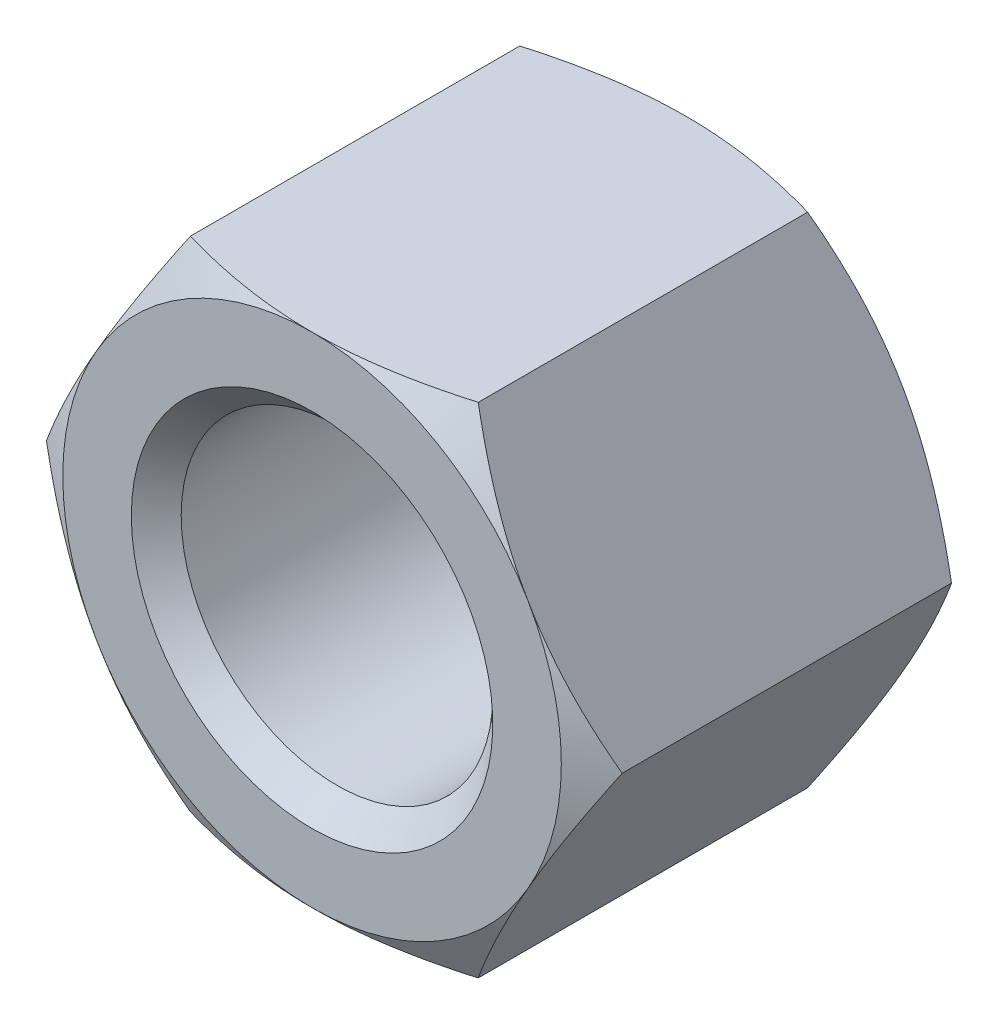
ISO-10303-21;
HEADER;
FILE_DESCRIPTION(('STEP AP214'),'2;1');
FILE_NAME('part.step','',(''),(''),'','','');
FILE_SCHEMA(('AUTOMOTIVE_DESIGN { 1 0 10303 214 1 1 1 1 }'));
ENDSEC;
DATA;
#1=APPLICATION_CONTEXT('core data for automotive mechanical design processes');
#2=APPLICATION_PROTOCOL_DEFINITION('international standard','automotive_design',2000,#1);
#3=PRODUCT_CONTEXT('',#1,'mechanical');
#4=PRODUCT('Part','Part','',(#3));
#5=PRODUCT_RELATED_PRODUCT_CATEGORY('part','',(#4));
#6=PRODUCT_DEFINITION_FORMATION('','',#4);
#7=PRODUCT_DEFINITION_CONTEXT('part definition',#1,'design');
#8=PRODUCT_DEFINITION('design','',#6,#7);
#9=PRODUCT_DEFINITION_SHAPE('','',#8);
#10=(LENGTH_UNIT() NAMED_UNIT(*) SI_UNIT(.MILLI.,.METRE.));
#11=(NAMED_UNIT(*) PLANE_ANGLE_UNIT() SI_UNIT($,.RADIAN.));
#12=(NAMED_UNIT(*) SI_UNIT($,.STERADIAN.) SOLID_ANGLE_UNIT());
#13=UNCERTAINTY_MEASURE_WITH_UNIT(LENGTH_MEASURE(1.E-05),#10,'distance_accuracy_value','');
#14=(GEOMETRIC_REPRESENTATION_CONTEXT(3) GLOBAL_UNCERTAINTY_ASSIGNED_CONTEXT((#13)) GLOBAL_UNIT_ASSIGNED_CONTEXT((#10,
#11,#12)) REPRESENTATION_CONTEXT('',''));
#15=CARTESIAN_POINT('',(0.,0.,0.));
#16=DIRECTION('',(0.,0.,1.));
#17=DIRECTION('',(1.,0.,0.));
#18=AXIS2_PLACEMENT_3D('',#15,#16,#17);
#19=CARTESIAN_POINT('',(4.61880215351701,0.,-3.));
#20=DIRECTION('',(0.866025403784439,0.5,0.));
#21=DIRECTION('',(-0.5,0.866025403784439,0.));
#22=AXIS2_PLACEMENT_3D('',#19,#20,#21);
#23=PLANE('',#22);
#24=CARTESIAN_POINT('',(4.61891762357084,-0.000199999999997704,2.64266774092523));
#25=CARTESIAN_POINT('',(4.51743148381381,0.17557915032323,2.70128212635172));
#26=CARTESIAN_POINT('',(4.41506932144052,0.352875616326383,2.75458967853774));
#27=CARTESIAN_POINT('',(4.20857250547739,0.710538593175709,2.8476383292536));
#28=CARTESIAN_POINT('',(4.10443418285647,0.890911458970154,2.8873465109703));
#29=CARTESIAN_POINT('',(3.89744813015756,1.24942181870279,2.94915778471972));
#30=CARTESIAN_POINT('',(3.79463224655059,1.42750415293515,2.97167226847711));
#31=CARTESIAN_POINT('',(3.58851671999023,1.78450671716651,2.99854937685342));
#32=CARTESIAN_POINT('',(3.48521782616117,1.9634256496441,3.00293425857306));
#33=CARTESIAN_POINT('',(3.29219970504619,2.29774284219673,2.99380992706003));
#34=CARTESIAN_POINT('',(3.20245157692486,2.45319115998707,2.98254104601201));
#35=CARTESIAN_POINT('',(3.02354002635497,2.76307505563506,2.94682600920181));
#36=CARTESIAN_POINT('',(2.93437722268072,2.91750956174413,2.92236765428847));
#37=CARTESIAN_POINT('',(2.75509682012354,3.22803232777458,2.86122393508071));
#38=CARTESIAN_POINT('',(2.6650019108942,3.3840812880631,2.82427939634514));
#39=CARTESIAN_POINT('',(2.48615580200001,3.69385183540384,2.74042992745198));
#40=CARTESIAN_POINT('',(2.39740231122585,3.84757739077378,2.69354469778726));
#41=CARTESIAN_POINT('',(2.30928560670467,4.0002,2.64266774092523));
#42=B_SPLINE_CURVE_WITH_KNOTS('',3,(#24,#25,#26,#27,#28,#29,#30,#31,#32,#33,#34,#35,#36,#37,#38,
#39,#40,#41),.UNSPECIFIED.,.F.,.F.,(4,2,2,2,2,2,2,2,4),(0.,0.634047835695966,1.26961969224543,
1.88946157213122,2.50854226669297,3.04757825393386,3.58711366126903,4.13861653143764,
4.68903648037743),.UNSPECIFIED.);
#43=CARTESIAN_POINT('',(4.61880215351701,0.,2.64273441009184));
#44=VERTEX_POINT('',#43);
#45=CARTESIAN_POINT('',(3.46410161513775,2.,3.));
#46=VERTEX_POINT('',#45);
#47=EDGE_CURVE('E127',#44,#46,#42,.T.);
#48=ORIENTED_EDGE('',*,*,#47,.F.);
#49=DIRECTION('',(0.,0.,1.));
#50=VECTOR('',#49,1.);
#51=CARTESIAN_POINT('',(4.61880215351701,0.,-3.));
#52=LINE('',#51,#50);
#53=CARTESIAN_POINT('',(4.61880215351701,0.,-2.64273441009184));
#54=VERTEX_POINT('',#53);
#55=EDGE_CURVE('E558',#54,#44,#52,.T.);
#56=ORIENTED_EDGE('',*,*,#55,.F.);
#57=CARTESIAN_POINT('',(4.61891762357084,-0.000199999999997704,-2.64266774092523));
#58=CARTESIAN_POINT('',(4.51743148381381,0.17557915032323,-2.70128212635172));
#59=CARTESIAN_POINT('',(4.41506932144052,0.352875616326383,-2.75458967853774));
#60=CARTESIAN_POINT('',(4.20857250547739,0.710538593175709,-2.8476383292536));
#61=CARTESIAN_POINT('',(4.10443418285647,0.890911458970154,-2.8873465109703));
#62=CARTESIAN_POINT('',(3.89744813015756,1.24942181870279,-2.94915778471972));
#63=CARTESIAN_POINT('',(3.79463224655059,1.42750415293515,-2.97167226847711));
#64=CARTESIAN_POINT('',(3.58851671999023,1.78450671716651,-2.99854937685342));
#65=CARTESIAN_POINT('',(3.48521782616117,1.9634256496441,-3.00293425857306));
#66=CARTESIAN_POINT('',(3.29219970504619,2.29774284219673,-2.99380992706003));
#67=CARTESIAN_POINT('',(3.20245157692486,2.45319115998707,-2.98254104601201));
#68=CARTESIAN_POINT('',(3.02354002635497,2.76307505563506,-2.94682600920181));
#69=CARTESIAN_POINT('',(2.93437722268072,2.91750956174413,-2.92236765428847));
#70=CARTESIAN_POINT('',(2.75509682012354,3.22803232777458,-2.86122393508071));
#71=CARTESIAN_POINT('',(2.6650019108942,3.3840812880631,-2.82427939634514));
#72=CARTESIAN_POINT('',(2.48615580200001,3.69385183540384,-2.74042992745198));
#73=CARTESIAN_POINT('',(2.39740231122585,3.84757739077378,-2.69354469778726));
#74=CARTESIAN_POINT('',(2.30928560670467,4.0002,-2.64266774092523));
#75=B_SPLINE_CURVE_WITH_KNOTS('',3,(#57,#58,#59,#60,#61,#62,#63,#64,#65,#66,#67,#68,#69,#70,#71,
#72,#73,#74),.UNSPECIFIED.,.F.,.F.,(4,2,2,2,2,2,2,2,4),(0.,0.634047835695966,1.26961969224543,
1.88946157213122,2.50854226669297,3.04757825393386,3.58711366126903,4.13861653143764,
4.68903648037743),.UNSPECIFIED.);
#76=CARTESIAN_POINT('',(3.46410161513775,2.,-3.));
#77=VERTEX_POINT('',#76);
#78=EDGE_CURVE('E540',#54,#77,#75,.T.);
#79=ORIENTED_EDGE('',*,*,#78,.T.);
#80=CARTESIAN_POINT('',(2.3094010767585,4.,-2.64273441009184));
#81=VERTEX_POINT('',#80);
#82=EDGE_CURVE('E269',#77,#81,#75,.T.);
#83=ORIENTED_EDGE('',*,*,#82,.T.);
#84=DIRECTION('',(0.,0.,1.));
#85=VECTOR('',#84,1.);
#86=CARTESIAN_POINT('',(2.3094010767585,4.,-3.));
#87=LINE('',#86,#85);
#88=CARTESIAN_POINT('',(2.3094010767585,4.,2.64273441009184));
#89=VERTEX_POINT('',#88);
#90=EDGE_CURVE('E159',#81,#89,#87,.T.);
#91=ORIENTED_EDGE('',*,*,#90,.T.);
#92=EDGE_CURVE('E140',#46,#89,#42,.T.);
#93=ORIENTED_EDGE('',*,*,#92,.F.);
#94=EDGE_LOOP('',(#48,#56,#79,#83,#91,#93));
#95=FACE_BOUND('',#94,.T.);
#96=ADVANCED_FACE('F41',(#95),#23,.T.);
#97=CARTESIAN_POINT('',(2.3094010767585,-4.,-3.));
#98=DIRECTION('',(0.866025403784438,-0.5,0.));
#99=DIRECTION('',(0.5,0.866025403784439,0.));
#100=AXIS2_PLACEMENT_3D('',#97,#98,#99);
#101=PLANE('',#100);
#102=CARTESIAN_POINT('',(2.30928560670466,-4.0002,2.64266774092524));
#103=CARTESIAN_POINT('',(2.4107717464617,-3.82442084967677,2.70128212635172));
#104=CARTESIAN_POINT('',(2.51313390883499,-3.64712438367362,2.75458967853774));
#105=CARTESIAN_POINT('',(2.71963072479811,-3.28946140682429,2.8476383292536));
#106=CARTESIAN_POINT('',(2.82376904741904,-3.10908854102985,2.8873465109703));
#107=CARTESIAN_POINT('',(3.03075510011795,-2.75057818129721,2.94915778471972));
#108=CARTESIAN_POINT('',(3.13357098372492,-2.57249584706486,2.97167226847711));
#109=CARTESIAN_POINT('',(3.33968651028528,-2.21549328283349,2.99854937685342));
#110=CARTESIAN_POINT('',(3.44298540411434,-2.0365743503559,3.00293425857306));
#111=CARTESIAN_POINT('',(3.63600352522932,-1.70225715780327,2.99380992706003));
#112=CARTESIAN_POINT('',(3.72575165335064,-1.54680884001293,2.98254104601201));
#113=CARTESIAN_POINT('',(3.90466320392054,-1.23692494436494,2.94682600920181));
#114=CARTESIAN_POINT('',(3.99382600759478,-1.08249043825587,2.92236765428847));
#115=CARTESIAN_POINT('',(4.17310641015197,-0.77196767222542,2.86122393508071));
#116=CARTESIAN_POINT('',(4.26320131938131,-0.615918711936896,2.82427939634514));
#117=CARTESIAN_POINT('',(4.4420474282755,-0.306148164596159,2.74042992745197));
#118=CARTESIAN_POINT('',(4.53080091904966,-0.152422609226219,2.69354469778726));
#119=CARTESIAN_POINT('',(4.61891762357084,0.000200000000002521,2.64266774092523));
#120=B_SPLINE_CURVE_WITH_KNOTS('',3,(#102,#103,#104,#105,#106,#107,#108,#109,#110,#111,#112,
#113,#114,#115,#116,#117,#118,#119),.UNSPECIFIED.,.F.,.F.,(4,2,2,2,2,2,2,2,4),(0.,
0.634047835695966,1.26961969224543,1.88946157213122,2.50854226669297,3.04757825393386,
3.58711366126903,4.13861653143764,4.68903648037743),.UNSPECIFIED.);
#121=CARTESIAN_POINT('',(2.3094010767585,-4.,2.64273441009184));
#122=VERTEX_POINT('',#121);
#123=CARTESIAN_POINT('',(3.46410161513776,-2.,3.));
#124=VERTEX_POINT('',#123);
#125=EDGE_CURVE('E533',#122,#124,#120,.T.);
#126=ORIENTED_EDGE('',*,*,#125,.F.);
#127=DIRECTION('',(0.,0.,1.));
#128=VECTOR('',#127,1.);
#129=CARTESIAN_POINT('',(2.3094010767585,-4.,-3.));
#130=LINE('',#129,#128);
#131=CARTESIAN_POINT('',(2.3094010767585,-4.,-2.64273441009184));
#132=VERTEX_POINT('',#131);
#133=EDGE_CURVE('E283',#132,#122,#130,.T.);
#134=ORIENTED_EDGE('',*,*,#133,.F.);
#135=CARTESIAN_POINT('',(2.30928560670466,-4.0002,-2.64266774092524));
#136=CARTESIAN_POINT('',(2.4107717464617,-3.82442084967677,-2.70128212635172));
#137=CARTESIAN_POINT('',(2.51313390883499,-3.64712438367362,-2.75458967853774));
#138=CARTESIAN_POINT('',(2.71963072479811,-3.28946140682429,-2.8476383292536));
#139=CARTESIAN_POINT('',(2.82376904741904,-3.10908854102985,-2.8873465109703));
#140=CARTESIAN_POINT('',(3.03075510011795,-2.75057818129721,-2.94915778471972));
#141=CARTESIAN_POINT('',(3.13357098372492,-2.57249584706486,-2.97167226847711));
#142=CARTESIAN_POINT('',(3.33968651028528,-2.21549328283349,-2.99854937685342));
#143=CARTESIAN_POINT('',(3.44298540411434,-2.0365743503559,-3.00293425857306));
#144=CARTESIAN_POINT('',(3.63600352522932,-1.70225715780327,-2.99380992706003));
#145=CARTESIAN_POINT('',(3.72575165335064,-1.54680884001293,-2.98254104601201));
#146=CARTESIAN_POINT('',(3.90466320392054,-1.23692494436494,-2.94682600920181));
#147=CARTESIAN_POINT('',(3.99382600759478,-1.08249043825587,-2.92236765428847));
#148=CARTESIAN_POINT('',(4.17310641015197,-0.77196767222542,-2.86122393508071));
#149=CARTESIAN_POINT('',(4.26320131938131,-0.615918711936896,-2.82427939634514));
#150=CARTESIAN_POINT('',(4.4420474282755,-0.306148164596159,-2.74042992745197));
#151=CARTESIAN_POINT('',(4.53080091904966,-0.152422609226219,-2.69354469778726));
#152=CARTESIAN_POINT('',(4.61891762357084,0.000200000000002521,-2.64266774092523));
#153=B_SPLINE_CURVE_WITH_KNOTS('',3,(#135,#136,#137,#138,#139,#140,#141,#142,#143,#144,#145,
#146,#147,#148,#149,#150,#151,#152),.UNSPECIFIED.,.F.,.F.,(4,2,2,2,2,2,2,2,4),(0.,
0.634047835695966,1.26961969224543,1.88946157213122,2.50854226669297,3.04757825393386,
3.58711366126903,4.13861653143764,4.68903648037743),.UNSPECIFIED.);
#154=CARTESIAN_POINT('',(3.46410161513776,-2.,-3.));
#155=VERTEX_POINT('',#154);
#156=EDGE_CURVE('E546',#132,#155,#153,.T.);
#157=ORIENTED_EDGE('',*,*,#156,.T.);
#158=EDGE_CURVE('E284',#155,#54,#153,.T.);
#159=ORIENTED_EDGE('',*,*,#158,.T.);
#160=ORIENTED_EDGE('',*,*,#55,.T.);
#161=EDGE_CURVE('E132',#124,#44,#120,.T.);
#162=ORIENTED_EDGE('',*,*,#161,.F.);
#163=EDGE_LOOP('',(#126,#134,#157,#159,#160,#162));
#164=FACE_BOUND('',#163,.T.);
#165=ADVANCED_FACE('F254',(#164),#101,.T.);
#166=CARTESIAN_POINT('',(-2.3094010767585,-4.,-3.));
#167=DIRECTION('',(0.,-1.,0.));
#168=DIRECTION('',(0.,0.,-1.));
#169=AXIS2_PLACEMENT_3D('',#166,#167,#168);
#170=PLANE('',#169);
#171=CARTESIAN_POINT('',(-9.20954650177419,-4.,-0.487602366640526));
#172=CARTESIAN_POINT('',(-8.99996160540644,-4.,-0.376626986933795));
#173=CARTESIAN_POINT('',(-8.79013626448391,-4.,-0.266102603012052));
#174=CARTESIAN_POINT('',(-8.36988903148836,-4.,-0.0461895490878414));
#175=CARTESIAN_POINT('',(-8.15946713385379,-4.,0.0631991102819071));
#176=CARTESIAN_POINT('',(-7.73766371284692,-4.,0.280734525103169));
#177=CARTESIAN_POINT('',(-7.52628134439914,-4.,0.388879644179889));
#178=CARTESIAN_POINT('',(-7.10265211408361,-4.,0.603471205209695));
#179=CARTESIAN_POINT('',(-6.89040524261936,-4.,0.709917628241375));
#180=CARTESIAN_POINT('',(-6.45325708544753,-4.,0.926433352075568));
#181=CARTESIAN_POINT('',(-6.22829678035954,-4.,1.03638375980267));
#182=CARTESIAN_POINT('',(-5.77692279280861,-4.,1.25324682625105));
#183=CARTESIAN_POINT('',(-5.55050916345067,-4.,1.36015959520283));
#184=CARTESIAN_POINT('',(-5.09596404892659,-4.,1.5699627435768));
#185=CARTESIAN_POINT('',(-4.86783354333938,-4.,1.67285523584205));
#186=CARTESIAN_POINT('',(-4.40921468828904,-4.,1.87337963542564));
#187=CARTESIAN_POINT('',(-4.17872594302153,-4.,1.9710106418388));
#188=CARTESIAN_POINT('',(-3.69446468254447,-4.,2.1673874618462));
#189=CARTESIAN_POINT('',(-3.44042380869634,-4.,2.26547932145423));
#190=CARTESIAN_POINT('',(-2.92809810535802,-4.,2.44970610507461));
#191=CARTESIAN_POINT('',(-2.66981494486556,-4.,2.53584561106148));
#192=CARTESIAN_POINT('',(-2.15306355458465,-4.,2.68974681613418));
#193=CARTESIAN_POINT('',(-1.89469451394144,-4.,2.75783024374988));
#194=CARTESIAN_POINT('',(-1.50352927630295,-4.,2.84322641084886));
#195=CARTESIAN_POINT('',(-1.37255212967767,-4.,2.8689019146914));
#196=CARTESIAN_POINT('',(-1.10952089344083,-4.,2.91390029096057));
#197=CARTESIAN_POINT('',(-0.977467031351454,-4.,2.93322447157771));
#198=CARTESIAN_POINT('',(-0.733112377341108,-4.,2.96238395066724));
#199=CARTESIAN_POINT('',(-0.620931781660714,-4.,2.97322729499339));
#200=CARTESIAN_POINT('',(-0.39619387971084,-4.,2.98959144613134));
#201=CARTESIAN_POINT('',(-0.283636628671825,-4.,2.99511300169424));
#202=CARTESIAN_POINT('',(-0.058408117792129,-4.,3.00066724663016));
#203=CARTESIAN_POINT('',(0.0542631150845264,-4.,3.00070102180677));
#204=CARTESIAN_POINT('',(0.27947370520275,-4.,2.9952816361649));
#205=CARTESIAN_POINT('',(0.392013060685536,-4.,2.98982840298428));
#206=CARTESIAN_POINT('',(0.61874511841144,-4.,2.97345272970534));
#207=CARTESIAN_POINT('',(0.732930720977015,-4.,2.96243274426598));
#208=CARTESIAN_POINT('',(0.960682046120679,-4.,2.93519991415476));
#209=CARTESIAN_POINT('',(1.07424773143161,-4.,2.9189867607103));
#210=CARTESIAN_POINT('',(1.30061751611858,-4.,2.88179418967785));
#211=CARTESIAN_POINT('',(1.41342143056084,-4.,2.86081365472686));
#212=CARTESIAN_POINT('',(1.63813713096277,-4.,2.81457504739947));
#213=CARTESIAN_POINT('',(1.75004894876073,-4.,2.78931712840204));
#214=CARTESIAN_POINT('',(2.02981552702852,-4.,2.72116797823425));
#215=CARTESIAN_POINT('',(2.1970807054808,-4.,2.67585504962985));
#216=CARTESIAN_POINT('',(2.52956420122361,-4.,2.57821125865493));
#217=CARTESIAN_POINT('',(2.69478201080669,-4.,2.52587869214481));
#218=CARTESIAN_POINT('',(3.02347594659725,-4.,2.41552751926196));
#219=CARTESIAN_POINT('',(3.18695019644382,-4.,2.35750336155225));
#220=CARTESIAN_POINT('',(3.51220118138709,-4.,2.23694186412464));
#221=CARTESIAN_POINT('',(3.67397804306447,-4.,2.17440486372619));
#222=CARTESIAN_POINT('',(3.99688309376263,-4.,2.04538407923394));
#223=CARTESIAN_POINT('',(4.15800398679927,-4.,1.9788821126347));
#224=CARTESIAN_POINT('',(4.47899441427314,-4.,1.84291723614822));
#225=CARTESIAN_POINT('',(4.63886389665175,-4.,1.77345420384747));
#226=CARTESIAN_POINT('',(5.1167060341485,-4.,1.56156399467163));
#227=CARTESIAN_POINT('',(5.43309229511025,-4.,1.41556228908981));
#228=CARTESIAN_POINT('',(6.04183433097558,-4.,1.1270656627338));
#229=CARTESIAN_POINT('',(6.33438800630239,-4.,0.984984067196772));
#230=CARTESIAN_POINT('',(6.91753132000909,-4.,0.696753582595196));
#231=CARTESIAN_POINT('',(7.20812068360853,-4.,0.550604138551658));
#232=CARTESIAN_POINT('',(7.78452192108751,-4.,0.256991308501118));
#233=CARTESIAN_POINT('',(8.07035078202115,-4.,0.109561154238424));
#234=CARTESIAN_POINT('',(8.64077734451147,-4.,-0.187515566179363));
#235=CARTESIAN_POINT('',(8.92537529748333,-4.,-0.337161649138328));
#236=CARTESIAN_POINT('',(9.20954650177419,-4.,-0.487602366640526));
#237=B_SPLINE_CURVE_WITH_KNOTS('',3,(#171,#172,#173,#174,#175,#176,#177,#178,#179,#180,#181,
#182,#183,#184,#185,#186,#187,#188,#189,#190,#191,#192,#193,#194,#195,#196,#197,#198,#199,#200,
#201,#202,#203,#204,#205,#206,#207,#208,#209,#210,#211,#212,#213,#214,#215,#216,#217,#218,#219,
#220,#221,#222,#223,#224,#225,#226,#227,#228,#229,#230,#231,#232,#233,#234,#235,#236),
.UNSPECIFIED.,.F.,.F.,(4,2,2,2,2,2,2,2,2,2,2,2,2,2,2,2,2,2,2,2,2,2,2,2,2,2,2,2,2,2,2,2,4),(0.,
0.711459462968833,1.42292558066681,2.13524004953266,2.84756244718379,3.5987213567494,
4.34985297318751,5.1005843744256,5.85144391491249,6.66819201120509,7.48462613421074,
8.28535063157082,8.68563323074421,9.08583333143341,9.42382667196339,9.76177245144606,
10.0996513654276,10.437534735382,10.7815555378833,11.1255967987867,11.4697187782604,
11.8138284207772,12.3335061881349,12.8533103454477,13.3736266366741,13.8939038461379,
14.4167843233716,14.9396864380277,15.9849079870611,16.9605651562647,17.9363560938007,
18.9011793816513,19.8657952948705),.UNSPECIFIED.);
#238=CARTESIAN_POINT('',(-2.3094010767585,-4.,2.64273441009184));
#239=VERTEX_POINT('',#238);
#240=CARTESIAN_POINT('',(0.,-4.,3.));
#241=VERTEX_POINT('',#240);
#242=EDGE_CURVE('E534',#239,#241,#237,.T.);
#243=ORIENTED_EDGE('',*,*,#242,.F.);
#244=DIRECTION('',(0.,0.,1.));
#245=VECTOR('',#244,1.);
#246=CARTESIAN_POINT('',(-2.3094010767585,-4.,-3.));
#247=LINE('',#246,#245);
#248=CARTESIAN_POINT('',(-2.3094010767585,-4.,-2.64273441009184));
#249=VERTEX_POINT('',#248);
#250=EDGE_CURVE('E565',#249,#239,#247,.T.);
#251=ORIENTED_EDGE('',*,*,#250,.F.);
#252=CARTESIAN_POINT('',(-7.8171716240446,-4.,-0.23961567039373));
#253=CARTESIAN_POINT('',(-7.63482522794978,-4.,-0.333323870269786));
#254=CARTESIAN_POINT('',(-7.45221019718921,-4.,-0.426513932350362));
#255=CARTESIAN_POINT('',(-7.08632048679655,-4.,-0.611598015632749));
#256=CARTESIAN_POINT('',(-6.90304579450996,-4.,-0.703492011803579));
#257=CARTESIAN_POINT('',(-6.53541813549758,-4.,-0.885871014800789));
#258=CARTESIAN_POINT('',(-6.35106388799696,-4.,-0.976353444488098));
#259=CARTESIAN_POINT('',(-5.98141987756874,-4.,-1.15539669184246));
#260=CARTESIAN_POINT('',(-5.7961301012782,-4.,-1.24395748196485));
#261=CARTESIAN_POINT('',(-5.41472519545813,-4.,-1.42325691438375));
#262=CARTESIAN_POINT('',(-5.21854988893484,-4.,-1.51386790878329));
#263=CARTESIAN_POINT('',(-4.82469000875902,-4.,-1.69173278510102));
#264=CARTESIAN_POINT('',(-4.62700551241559,-4.,-1.7789868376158));
#265=CARTESIAN_POINT('',(-4.22991127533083,-4.,-1.94912171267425));
#266=CARTESIAN_POINT('',(-4.03050278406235,-4.,-2.03200543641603));
#267=CARTESIAN_POINT('',(-3.62937916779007,-4.,-2.19216898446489));
#268=CARTESIAN_POINT('',(-3.42766351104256,-4.,-2.26944748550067));
#269=CARTESIAN_POINT('',(-2.98791439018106,-4.,-2.42879916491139));
#270=CARTESIAN_POINT('',(-2.74939574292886,-4.,-2.50954893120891));
#271=CARTESIAN_POINT('',(-2.26811225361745,-4.,-2.65717758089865));
#272=CARTESIAN_POINT('',(-2.02534965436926,-4.,-2.72406356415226));
#273=CARTESIAN_POINT('',(-1.66021619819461,-4.,-2.80978198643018));
#274=CARTESIAN_POINT('',(-1.53951118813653,-4.,-2.8357368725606));
#275=CARTESIAN_POINT('',(-1.29710140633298,-4.,-2.88250847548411));
#276=CARTESIAN_POINT('',(-1.1753966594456,-4.,-2.90332531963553));
#277=CARTESIAN_POINT('',(-0.931192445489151,-4.,-2.93922594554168));
#278=CARTESIAN_POINT('',(-0.808693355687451,-4.,-2.95431227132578));
#279=CARTESIAN_POINT('',(-0.563090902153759,-4.,-2.97827634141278));
#280=CARTESIAN_POINT('',(-0.439987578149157,-4.,-2.98715448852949));
#281=CARTESIAN_POINT('',(-0.191866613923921,-4.,-2.99846167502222));
#282=CARTESIAN_POINT('',(-0.0668450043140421,-4.,-3.00080479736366));
#283=CARTESIAN_POINT('',(0.18314024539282,-4.,-2.99870720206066));
#284=CARTESIAN_POINT('',(0.30810388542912,-4.,-2.99426647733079));
#285=CARTESIAN_POINT('',(0.557653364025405,-4.,-2.97876571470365));
#286=CARTESIAN_POINT('',(0.682239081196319,-4.,-2.96770373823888));
#287=CARTESIAN_POINT('',(0.930690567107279,-4.,-2.93935627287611));
#288=CARTESIAN_POINT('',(1.05455631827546,-4.,-2.92207063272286));
#289=CARTESIAN_POINT('',(1.42966198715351,-4.,-2.86088380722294));
#290=CARTESIAN_POINT('',(1.67945407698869,-4.,-2.80799457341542));
#291=CARTESIAN_POINT('',(2.17436827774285,-4.,-2.68401694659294));
#292=CARTESIAN_POINT('',(2.41948902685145,-4.,-2.61292333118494));
#293=CARTESIAN_POINT('',(2.89303108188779,-4.,-2.46142937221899));
#294=CARTESIAN_POINT('',(3.12166672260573,-4.,-2.38168814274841));
#295=CARTESIAN_POINT('',(3.57570202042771,-4.,-2.21341780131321));
#296=CARTESIAN_POINT('',(3.80110092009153,-4.,-2.1248866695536));
#297=CARTESIAN_POINT('',(4.249469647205,-4.,-1.9412649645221));
#298=CARTESIAN_POINT('',(4.47243664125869,-4.,-1.84616752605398));
#299=CARTESIAN_POINT('',(4.91621359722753,-4.,-1.6511471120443));
#300=CARTESIAN_POINT('',(5.13702376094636,-4.,-1.55122459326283));
#301=CARTESIAN_POINT('',(5.56467834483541,-4.,-1.35338346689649));
#302=CARTESIAN_POINT('',(5.77161510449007,-4.,-1.25566367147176));
#303=CARTESIAN_POINT('',(6.18426265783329,-4.,-1.05765810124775));
#304=CARTESIAN_POINT('',(6.38997341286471,-4.,-0.9573722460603));
#305=CARTESIAN_POINT('',(6.79974068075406,-4.,-0.755092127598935));
#306=CARTESIAN_POINT('',(7.003800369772,-4.,-0.653104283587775));
#307=CARTESIAN_POINT('',(7.41107383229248,-4.,-0.447494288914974));
#308=CARTESIAN_POINT('',(7.61428767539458,-4.,-0.343872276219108));
#309=CARTESIAN_POINT('',(7.8171716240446,-4.,-0.239615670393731));
#310=B_SPLINE_CURVE_WITH_KNOTS('',3,(#252,#253,#254,#255,#256,#257,#258,#259,#260,#261,#262,
#263,#264,#265,#266,#267,#268,#269,#270,#271,#272,#273,#274,#275,#276,#277,#278,#279,#280,#281,
#282,#283,#284,#285,#286,#287,#288,#289,#290,#291,#292,#293,#294,#295,#296,#297,#298,#299,#300,
#301,#302,#303,#304,#305,#306,#307,#308,#309),.UNSPECIFIED.,.F.,.F.,(4,2,2,2,2,2,2,2,2,2,2,2,2,
2,2,2,2,2,2,2,2,2,2,2,2,2,2,2,4),(0.,0.615049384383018,1.23011063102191,1.84618749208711,
2.46227317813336,3.11052008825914,3.75873401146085,4.40651206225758,5.05444254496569,
5.80961343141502,6.56439662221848,6.9346972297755,7.30498865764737,7.67511550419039,
8.04521833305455,8.4201645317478,8.79511112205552,9.17016754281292,9.54523307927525,
10.3102047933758,11.075396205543,11.8015833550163,12.5279377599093,13.2550634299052,
13.9821204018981,14.6686467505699,15.3551946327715,16.0395673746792,16.7238826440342),.UNSPECIFIED.);
#311=CARTESIAN_POINT('',(0.,-4.,-3.));
#312=VERTEX_POINT('',#311);
#313=EDGE_CURVE('E538',#249,#312,#310,.T.);
#314=ORIENTED_EDGE('',*,*,#313,.T.);
#315=EDGE_CURVE('E259',#312,#132,#310,.T.);
#316=ORIENTED_EDGE('',*,*,#315,.T.);
#317=ORIENTED_EDGE('',*,*,#133,.T.);
#318=EDGE_CURVE('E138',#241,#122,#237,.T.);
#319=ORIENTED_EDGE('',*,*,#318,.F.);
#320=EDGE_LOOP('',(#243,#251,#314,#316,#317,#319));
#321=FACE_BOUND('',#320,.T.);
#322=ADVANCED_FACE('F292',(#321),#170,.T.);
#323=CARTESIAN_POINT('',(-4.61880215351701,0.,-3.));
#324=DIRECTION('',(-0.866025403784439,-0.5,0.));
#325=DIRECTION('',(0.5,-0.866025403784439,0.));
#326=AXIS2_PLACEMENT_3D('',#323,#324,#325);
#327=PLANE('',#326);
#328=CARTESIAN_POINT('',(-4.61891762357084,0.000200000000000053,2.64266774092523));
#329=CARTESIAN_POINT('',(-4.5174314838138,-0.175579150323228,2.70128212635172));
#330=CARTESIAN_POINT('',(-4.41506932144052,-0.352875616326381,2.75458967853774));
#331=CARTESIAN_POINT('',(-4.20857250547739,-0.710538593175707,2.8476383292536));
#332=CARTESIAN_POINT('',(-4.10443418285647,-0.890911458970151,2.8873465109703));
#333=CARTESIAN_POINT('',(-3.89744813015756,-1.24942181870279,2.94915778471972));
#334=CARTESIAN_POINT('',(-3.79463224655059,-1.42750415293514,2.97167226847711));
#335=CARTESIAN_POINT('',(-3.58851671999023,-1.78450671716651,2.99854937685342));
#336=CARTESIAN_POINT('',(-3.48521782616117,-1.9634256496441,3.00293425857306));
#337=CARTESIAN_POINT('',(-3.29219970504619,-2.29774284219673,2.99380992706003));
#338=CARTESIAN_POINT('',(-3.20245157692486,-2.45319115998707,2.98254104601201));
#339=CARTESIAN_POINT('',(-3.02354002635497,-2.76307505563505,2.94682600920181));
#340=CARTESIAN_POINT('',(-2.93437722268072,-2.91750956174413,2.92236765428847));
#341=CARTESIAN_POINT('',(-2.75509682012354,-3.22803232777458,2.86122393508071));
#342=CARTESIAN_POINT('',(-2.6650019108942,-3.3840812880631,2.82427939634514));
#343=CARTESIAN_POINT('',(-2.48615580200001,-3.69385183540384,2.74042992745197));
#344=CARTESIAN_POINT('',(-2.39740231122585,-3.84757739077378,2.69354469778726));
#345=CARTESIAN_POINT('',(-2.30928560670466,-4.0002,2.64266774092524));
#346=B_SPLINE_CURVE_WITH_KNOTS('',3,(#328,#329,#330,#331,#332,#333,#334,#335,#336,#337,#338,
#339,#340,#341,#342,#343,#344,#345),.UNSPECIFIED.,.F.,.F.,(4,2,2,2,2,2,2,2,4),(0.,
0.634047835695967,1.26961969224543,1.88946157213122,2.50854226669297,3.04757825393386,
3.58711366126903,4.13861653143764,4.68903648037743),.UNSPECIFIED.);
#347=CARTESIAN_POINT('',(-4.61880215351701,0.,2.64273441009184));
#348=VERTEX_POINT('',#347);
#349=CARTESIAN_POINT('',(-3.46410161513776,-2.,3.));
#350=VERTEX_POINT('',#349);
#351=EDGE_CURVE('E176',#348,#350,#346,.T.);
#352=ORIENTED_EDGE('',*,*,#351,.F.);
#353=DIRECTION('',(0.,0.,1.));
#354=VECTOR('',#353,1.);
#355=CARTESIAN_POINT('',(-4.61880215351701,0.,-3.));
#356=LINE('',#355,#354);
#357=CARTESIAN_POINT('',(-4.61880215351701,0.,-2.64273441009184));
#358=VERTEX_POINT('',#357);
#359=EDGE_CURVE('E584',#358,#348,#356,.T.);
#360=ORIENTED_EDGE('',*,*,#359,.F.);
#361=CARTESIAN_POINT('',(-4.61891762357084,0.000200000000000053,-2.64266774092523));
#362=CARTESIAN_POINT('',(-4.5174314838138,-0.175579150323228,-2.70128212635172));
#363=CARTESIAN_POINT('',(-4.41506932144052,-0.352875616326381,-2.75458967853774));
#364=CARTESIAN_POINT('',(-4.20857250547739,-0.710538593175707,-2.8476383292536));
#365=CARTESIAN_POINT('',(-4.10443418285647,-0.890911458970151,-2.8873465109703));
#366=CARTESIAN_POINT('',(-3.89744813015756,-1.24942181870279,-2.94915778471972));
#367=CARTESIAN_POINT('',(-3.79463224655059,-1.42750415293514,-2.97167226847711));
#368=CARTESIAN_POINT('',(-3.58851671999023,-1.78450671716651,-2.99854937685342));
#369=CARTESIAN_POINT('',(-3.48521782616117,-1.9634256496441,-3.00293425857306));
#370=CARTESIAN_POINT('',(-3.29219970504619,-2.29774284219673,-2.99380992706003));
#371=CARTESIAN_POINT('',(-3.20245157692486,-2.45319115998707,-2.98254104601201));
#372=CARTESIAN_POINT('',(-3.02354002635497,-2.76307505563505,-2.94682600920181));
#373=CARTESIAN_POINT('',(-2.93437722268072,-2.91750956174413,-2.92236765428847));
#374=CARTESIAN_POINT('',(-2.75509682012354,-3.22803232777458,-2.86122393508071));
#375=CARTESIAN_POINT('',(-2.6650019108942,-3.3840812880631,-2.82427939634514));
#376=CARTESIAN_POINT('',(-2.48615580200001,-3.69385183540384,-2.74042992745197));
#377=CARTESIAN_POINT('',(-2.39740231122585,-3.84757739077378,-2.69354469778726));
#378=CARTESIAN_POINT('',(-2.30928560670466,-4.0002,-2.64266774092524));
#379=B_SPLINE_CURVE_WITH_KNOTS('',3,(#361,#362,#363,#364,#365,#366,#367,#368,#369,#370,#371,
#372,#373,#374,#375,#376,#377,#378),.UNSPECIFIED.,.F.,.F.,(4,2,2,2,2,2,2,2,4),(0.,
0.634047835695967,1.26961969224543,1.88946157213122,2.50854226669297,3.04757825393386,
3.58711366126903,4.13861653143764,4.68903648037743),.UNSPECIFIED.);
#380=CARTESIAN_POINT('',(-3.46410161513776,-2.,-3.));
#381=VERTEX_POINT('',#380);
#382=EDGE_CURVE('E275',#358,#381,#379,.T.);
#383=ORIENTED_EDGE('',*,*,#382,.T.);
#384=EDGE_CURVE('E282',#381,#249,#379,.T.);
#385=ORIENTED_EDGE('',*,*,#384,.T.);
#386=ORIENTED_EDGE('',*,*,#250,.T.);
#387=EDGE_CURVE('E530',#350,#239,#346,.T.);
#388=ORIENTED_EDGE('',*,*,#387,.F.);
#389=EDGE_LOOP('',(#352,#360,#383,#385,#386,#388));
#390=FACE_BOUND('',#389,.T.);
#391=ADVANCED_FACE('F289',(#390),#327,.T.);
#392=CARTESIAN_POINT('',(-2.3094010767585,4.,-3.));
#393=DIRECTION('',(-0.866025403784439,0.5,0.));
#394=DIRECTION('',(-0.5,-0.866025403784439,0.));
#395=AXIS2_PLACEMENT_3D('',#392,#393,#394);
#396=PLANE('',#395);
#397=CARTESIAN_POINT('',(-2.30928560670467,4.0002,2.64266774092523));
#398=CARTESIAN_POINT('',(-2.41077174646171,3.82442084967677,2.70128212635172));
#399=CARTESIAN_POINT('',(-2.513133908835,3.64712438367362,2.75458967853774));
#400=CARTESIAN_POINT('',(-2.71963072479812,3.28946140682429,2.8476383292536));
#401=CARTESIAN_POINT('',(-2.82376904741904,3.10908854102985,2.8873465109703));
#402=CARTESIAN_POINT('',(-3.03075510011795,2.75057818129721,2.94915778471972));
#403=CARTESIAN_POINT('',(-3.13357098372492,2.57249584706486,2.97167226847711));
#404=CARTESIAN_POINT('',(-3.33968651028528,2.21549328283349,2.99854937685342));
#405=CARTESIAN_POINT('',(-3.44298540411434,2.0365743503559,3.00293425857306));
#406=CARTESIAN_POINT('',(-3.63600352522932,1.70225715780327,2.99380992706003));
#407=CARTESIAN_POINT('',(-3.72575165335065,1.54680884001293,2.98254104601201));
#408=CARTESIAN_POINT('',(-3.90466320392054,1.23692494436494,2.94682600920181));
#409=CARTESIAN_POINT('',(-3.99382600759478,1.08249043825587,2.92236765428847));
#410=CARTESIAN_POINT('',(-4.17310641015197,0.771967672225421,2.86122393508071));
#411=CARTESIAN_POINT('',(-4.26320131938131,0.615918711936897,2.82427939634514));
#412=CARTESIAN_POINT('',(-4.4420474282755,0.306148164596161,2.74042992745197));
#413=CARTESIAN_POINT('',(-4.53080091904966,0.152422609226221,2.69354469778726));
#414=CARTESIAN_POINT('',(-4.61891762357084,-0.000199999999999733,2.64266774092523));
#415=B_SPLINE_CURVE_WITH_KNOTS('',3,(#397,#398,#399,#400,#401,#402,#403,#404,#405,#406,#407,
#408,#409,#410,#411,#412,#413,#414),.UNSPECIFIED.,.F.,.F.,(4,2,2,2,2,2,2,2,4),(0.,
0.634047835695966,1.26961969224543,1.88946157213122,2.50854226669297,3.04757825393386,
3.58711366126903,4.13861653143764,4.68903648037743),.UNSPECIFIED.);
#416=CARTESIAN_POINT('',(-2.30940107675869,4.,2.64273441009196));
#417=VERTEX_POINT('',#416);
#418=CARTESIAN_POINT('',(-3.46410161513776,2.,3.));
#419=VERTEX_POINT('',#418);
#420=EDGE_CURVE('E183',#417,#419,#415,.T.);
#421=ORIENTED_EDGE('',*,*,#420,.F.);
#422=DIRECTION('',(0.,0.,1.));
#423=VECTOR('',#422,1.);
#424=CARTESIAN_POINT('',(-2.3094010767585,4.,-3.));
#425=LINE('',#424,#423);
#426=CARTESIAN_POINT('',(-2.3094010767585,4.,-2.64273441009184));
#427=VERTEX_POINT('',#426);
#428=EDGE_CURVE('E233',#427,#417,#425,.T.);
#429=ORIENTED_EDGE('',*,*,#428,.F.);
#430=CARTESIAN_POINT('',(-2.30928560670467,4.0002,-2.64266774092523));
#431=CARTESIAN_POINT('',(-2.41077174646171,3.82442084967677,-2.70128212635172));
#432=CARTESIAN_POINT('',(-2.513133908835,3.64712438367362,-2.75458967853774));
#433=CARTESIAN_POINT('',(-2.71963072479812,3.28946140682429,-2.8476383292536));
#434=CARTESIAN_POINT('',(-2.82376904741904,3.10908854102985,-2.8873465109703));
#435=CARTESIAN_POINT('',(-3.03075510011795,2.75057818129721,-2.94915778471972));
#436=CARTESIAN_POINT('',(-3.13357098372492,2.57249584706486,-2.97167226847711));
#437=CARTESIAN_POINT('',(-3.33968651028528,2.21549328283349,-2.99854937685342));
#438=CARTESIAN_POINT('',(-3.44298540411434,2.0365743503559,-3.00293425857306));
#439=CARTESIAN_POINT('',(-3.63600352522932,1.70225715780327,-2.99380992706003));
#440=CARTESIAN_POINT('',(-3.72575165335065,1.54680884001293,-2.98254104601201));
#441=CARTESIAN_POINT('',(-3.90466320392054,1.23692494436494,-2.94682600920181));
#442=CARTESIAN_POINT('',(-3.99382600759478,1.08249043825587,-2.92236765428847));
#443=CARTESIAN_POINT('',(-4.17310641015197,0.771967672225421,-2.86122393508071));
#444=CARTESIAN_POINT('',(-4.26320131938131,0.615918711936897,-2.82427939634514));
#445=CARTESIAN_POINT('',(-4.4420474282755,0.306148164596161,-2.74042992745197));
#446=CARTESIAN_POINT('',(-4.53080091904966,0.152422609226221,-2.69354469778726));
#447=CARTESIAN_POINT('',(-4.61891762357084,-0.000199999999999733,-2.64266774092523));
#448=B_SPLINE_CURVE_WITH_KNOTS('',3,(#430,#431,#432,#433,#434,#435,#436,#437,#438,#439,#440,
#441,#442,#443,#444,#445,#446,#447),.UNSPECIFIED.,.F.,.F.,(4,2,2,2,2,2,2,2,4),(0.,
0.634047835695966,1.26961969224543,1.88946157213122,2.50854226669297,3.04757825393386,
3.58711366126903,4.13861653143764,4.68903648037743),.UNSPECIFIED.);
#449=CARTESIAN_POINT('',(-3.46410161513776,2.,-3.));
#450=VERTEX_POINT('',#449);
#451=EDGE_CURVE('E237',#427,#450,#448,.T.);
#452=ORIENTED_EDGE('',*,*,#451,.T.);
#453=EDGE_CURVE('E564',#450,#358,#448,.T.);
#454=ORIENTED_EDGE('',*,*,#453,.T.);
#455=ORIENTED_EDGE('',*,*,#359,.T.);
#456=EDGE_CURVE('E602',#419,#348,#415,.T.);
#457=ORIENTED_EDGE('',*,*,#456,.F.);
#458=EDGE_LOOP('',(#421,#429,#452,#454,#455,#457));
#459=FACE_BOUND('',#458,.T.);
#460=ADVANCED_FACE('F218',(#459),#396,.T.);
#461=CARTESIAN_POINT('',(2.3094010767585,4.,-3.));
#462=DIRECTION('',(0.,1.,0.));
#463=DIRECTION('',(0.,0.,1.));
#464=AXIS2_PLACEMENT_3D('',#461,#462,#463);
#465=PLANE('',#464);
#466=CARTESIAN_POINT('',(9.20954650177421,4.,-0.487602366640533));
#467=CARTESIAN_POINT('',(8.99996160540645,4.,-0.376626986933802));
#468=CARTESIAN_POINT('',(8.79013626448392,4.,-0.266102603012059));
#469=CARTESIAN_POINT('',(8.36988903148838,4.,-0.0461895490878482));
#470=CARTESIAN_POINT('',(8.15946713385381,4.,0.0631991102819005));
#471=CARTESIAN_POINT('',(7.73766371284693,4.,0.280734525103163));
#472=CARTESIAN_POINT('',(7.52628134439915,4.,0.388879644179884));
#473=CARTESIAN_POINT('',(7.10265211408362,4.,0.60347120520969));
#474=CARTESIAN_POINT('',(6.89040524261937,4.,0.709917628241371));
#475=CARTESIAN_POINT('',(6.45325708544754,4.,0.926433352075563));
#476=CARTESIAN_POINT('',(6.22829678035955,4.,1.03638375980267));
#477=CARTESIAN_POINT('',(5.77692279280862,4.,1.25324682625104));
#478=CARTESIAN_POINT('',(5.55050916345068,4.,1.36015959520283));
#479=CARTESIAN_POINT('',(5.0959640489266,4.,1.5699627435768));
#480=CARTESIAN_POINT('',(4.86783354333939,4.,1.67285523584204));
#481=CARTESIAN_POINT('',(4.40921468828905,4.,1.87337963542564));
#482=CARTESIAN_POINT('',(4.17872594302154,4.,1.97101064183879));
#483=CARTESIAN_POINT('',(3.69446468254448,4.,2.1673874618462));
#484=CARTESIAN_POINT('',(3.44042380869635,4.,2.26547932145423));
#485=CARTESIAN_POINT('',(2.92809810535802,4.,2.44970610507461));
#486=CARTESIAN_POINT('',(2.66981494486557,4.,2.53584561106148));
#487=CARTESIAN_POINT('',(2.15306355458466,4.,2.68974681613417));
#488=CARTESIAN_POINT('',(1.89469451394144,4.,2.75783024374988));
#489=CARTESIAN_POINT('',(1.50352927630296,4.,2.84322641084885));
#490=CARTESIAN_POINT('',(1.37255212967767,4.,2.8689019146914));
#491=CARTESIAN_POINT('',(1.10952089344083,4.,2.91390029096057));
#492=CARTESIAN_POINT('',(0.977467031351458,4.,2.93322447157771));
#493=CARTESIAN_POINT('',(0.733112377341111,4.,2.96238395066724));
#494=CARTESIAN_POINT('',(0.620931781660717,4.,2.97322729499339));
#495=CARTESIAN_POINT('',(0.396193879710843,4.,2.98959144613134));
#496=CARTESIAN_POINT('',(0.283636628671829,4.,2.99511300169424));
#497=CARTESIAN_POINT('',(0.0584081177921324,4.,3.00066724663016));
#498=CARTESIAN_POINT('',(-0.0542631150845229,4.,3.00070102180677));
#499=CARTESIAN_POINT('',(-0.279473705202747,4.,2.9952816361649));
#500=CARTESIAN_POINT('',(-0.392013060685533,4.,2.98982840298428));
#501=CARTESIAN_POINT('',(-0.618745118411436,4.,2.97345272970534));
#502=CARTESIAN_POINT('',(-0.732930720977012,4.,2.96243274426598));
#503=CARTESIAN_POINT('',(-0.960682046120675,4.,2.93519991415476));
#504=CARTESIAN_POINT('',(-1.07424773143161,4.,2.9189867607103));
#505=CARTESIAN_POINT('',(-1.30061751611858,4.,2.88179418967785));
#506=CARTESIAN_POINT('',(-1.41342143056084,4.,2.86081365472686));
#507=CARTESIAN_POINT('',(-1.63813713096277,4.,2.81457504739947));
#508=CARTESIAN_POINT('',(-1.75004894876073,4.,2.78931712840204));
#509=CARTESIAN_POINT('',(-2.02981552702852,4.,2.72116797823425));
#510=CARTESIAN_POINT('',(-2.1970807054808,4.,2.67585504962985));
#511=CARTESIAN_POINT('',(-2.52956420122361,4.,2.57821125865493));
#512=CARTESIAN_POINT('',(-2.69478201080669,4.,2.52587869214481));
#513=CARTESIAN_POINT('',(-3.02347594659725,4.,2.41552751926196));
#514=CARTESIAN_POINT('',(-3.18695019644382,4.,2.35750336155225));
#515=CARTESIAN_POINT('',(-3.5122011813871,4.,2.23694186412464));
#516=CARTESIAN_POINT('',(-3.67397804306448,4.,2.17440486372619));
#517=CARTESIAN_POINT('',(-3.99688309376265,4.,2.04538407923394));
#518=CARTESIAN_POINT('',(-4.15800398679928,4.,1.9788821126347));
#519=CARTESIAN_POINT('',(-4.47899441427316,4.,1.84291723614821));
#520=CARTESIAN_POINT('',(-4.63886389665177,4.,1.77345420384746));
#521=CARTESIAN_POINT('',(-5.11670603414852,4.,1.56156399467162));
#522=CARTESIAN_POINT('',(-5.43309229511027,4.,1.4155622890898));
#523=CARTESIAN_POINT('',(-6.0418343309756,4.,1.12706566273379));
#524=CARTESIAN_POINT('',(-6.33438800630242,4.,0.984984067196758));
#525=CARTESIAN_POINT('',(-6.91753132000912,4.,0.696753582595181));
#526=CARTESIAN_POINT('',(-7.20812068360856,4.,0.550604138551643));
#527=CARTESIAN_POINT('',(-7.78452192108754,4.,0.256991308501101));
#528=CARTESIAN_POINT('',(-8.07035078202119,4.,0.109561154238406));
#529=CARTESIAN_POINT('',(-8.64077734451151,4.,-0.187515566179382));
#530=CARTESIAN_POINT('',(-8.92537529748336,4.,-0.337161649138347));
#531=CARTESIAN_POINT('',(-9.20954650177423,4.,-0.487602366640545));
#532=B_SPLINE_CURVE_WITH_KNOTS('',3,(#466,#467,#468,#469,#470,#471,#472,#473,#474,#475,#476,
#477,#478,#479,#480,#481,#482,#483,#484,#485,#486,#487,#488,#489,#490,#491,#492,#493,#494,#495,
#496,#497,#498,#499,#500,#501,#502,#503,#504,#505,#506,#507,#508,#509,#510,#511,#512,#513,#514,
#515,#516,#517,#518,#519,#520,#521,#522,#523,#524,#525,#526,#527,#528,#529,#530,#531),
.UNSPECIFIED.,.F.,.F.,(4,2,2,2,2,2,2,2,2,2,2,2,2,2,2,2,2,2,2,2,2,2,2,2,2,2,2,2,2,2,2,2,4),(0.,
0.711459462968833,1.42292558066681,2.13524004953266,2.84756244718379,3.5987213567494,
4.34985297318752,5.10058437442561,5.8514439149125,6.6681920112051,7.48462613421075,
8.28535063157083,8.68563323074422,9.08583333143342,9.4238266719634,9.76177245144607,
10.0996513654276,10.437534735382,10.7815555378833,11.1255967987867,11.4697187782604,
11.8138284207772,12.3335061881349,12.8533103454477,13.3736266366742,13.8939038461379,
14.4167843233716,14.9396864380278,15.9849079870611,16.9605651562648,17.9363560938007,
18.9011793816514,19.8657952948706),.UNSPECIFIED.);
#533=CARTESIAN_POINT('',(0.,4.,3.));
#534=VERTEX_POINT('',#533);
#535=EDGE_CURVE('E145',#89,#534,#532,.T.);
#536=ORIENTED_EDGE('',*,*,#535,.F.);
#537=ORIENTED_EDGE('',*,*,#90,.F.);
#538=CARTESIAN_POINT('',(7.81717162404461,4.,-0.239615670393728));
#539=CARTESIAN_POINT('',(7.63482522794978,4.,-0.333323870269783));
#540=CARTESIAN_POINT('',(7.45221019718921,4.,-0.42651393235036));
#541=CARTESIAN_POINT('',(7.08632048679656,4.,-0.611598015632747));
#542=CARTESIAN_POINT('',(6.90304579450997,4.,-0.703492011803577));
#543=CARTESIAN_POINT('',(6.53541813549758,4.,-0.885871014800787));
#544=CARTESIAN_POINT('',(6.35106388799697,4.,-0.976353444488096));
#545=CARTESIAN_POINT('',(5.98141987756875,4.,-1.15539669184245));
#546=CARTESIAN_POINT('',(5.7961301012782,4.,-1.24395748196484));
#547=CARTESIAN_POINT('',(5.41472519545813,4.,-1.42325691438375));
#548=CARTESIAN_POINT('',(5.21854988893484,4.,-1.51386790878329));
#549=CARTESIAN_POINT('',(4.82469000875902,4.,-1.69173278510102));
#550=CARTESIAN_POINT('',(4.62700551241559,4.,-1.7789868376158));
#551=CARTESIAN_POINT('',(4.22991127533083,4.,-1.94912171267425));
#552=CARTESIAN_POINT('',(4.03050278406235,4.,-2.03200543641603));
#553=CARTESIAN_POINT('',(3.62937916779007,4.,-2.19216898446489));
#554=CARTESIAN_POINT('',(3.42766351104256,4.,-2.26944748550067));
#555=CARTESIAN_POINT('',(2.98791439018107,4.,-2.42879916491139));
#556=CARTESIAN_POINT('',(2.74939574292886,4.,-2.5095489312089));
#557=CARTESIAN_POINT('',(2.26811225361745,4.,-2.65717758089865));
#558=CARTESIAN_POINT('',(2.02534965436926,4.,-2.72406356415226));
#559=CARTESIAN_POINT('',(1.66021619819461,4.,-2.80978198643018));
#560=CARTESIAN_POINT('',(1.53951118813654,4.,-2.8357368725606));
#561=CARTESIAN_POINT('',(1.29710140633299,4.,-2.88250847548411));
#562=CARTESIAN_POINT('',(1.1753966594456,4.,-2.90332531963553));
#563=CARTESIAN_POINT('',(0.931192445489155,4.,-2.93922594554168));
#564=CARTESIAN_POINT('',(0.808693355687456,4.,-2.95431227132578));
#565=CARTESIAN_POINT('',(0.563090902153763,4.,-2.97827634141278));
#566=CARTESIAN_POINT('',(0.439987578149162,4.,-2.98715448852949));
#567=CARTESIAN_POINT('',(0.191866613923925,4.,-2.99846167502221));
#568=CARTESIAN_POINT('',(0.0668450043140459,4.,-3.00080479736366));
#569=CARTESIAN_POINT('',(-0.183140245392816,4.,-2.99870720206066));
#570=CARTESIAN_POINT('',(-0.308103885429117,4.,-2.99426647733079));
#571=CARTESIAN_POINT('',(-0.557653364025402,4.,-2.97876571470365));
#572=CARTESIAN_POINT('',(-0.682239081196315,4.,-2.96770373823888));
#573=CARTESIAN_POINT('',(-0.930690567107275,4.,-2.93935627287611));
#574=CARTESIAN_POINT('',(-1.05455631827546,4.,-2.92207063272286));
#575=CARTESIAN_POINT('',(-1.42966198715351,4.,-2.86088380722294));
#576=CARTESIAN_POINT('',(-1.67945407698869,4.,-2.80799457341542));
#577=CARTESIAN_POINT('',(-2.17436827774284,4.,-2.68401694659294));
#578=CARTESIAN_POINT('',(-2.41948902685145,4.,-2.61292333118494));
#579=CARTESIAN_POINT('',(-2.89303108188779,4.,-2.46142937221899));
#580=CARTESIAN_POINT('',(-3.12166672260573,4.,-2.38168814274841));
#581=CARTESIAN_POINT('',(-3.57570202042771,4.,-2.21341780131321));
#582=CARTESIAN_POINT('',(-3.80110092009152,4.,-2.1248866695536));
#583=CARTESIAN_POINT('',(-4.249469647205,4.,-1.9412649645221));
#584=CARTESIAN_POINT('',(-4.47243664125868,4.,-1.84616752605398));
#585=CARTESIAN_POINT('',(-4.91621359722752,4.,-1.6511471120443));
#586=CARTESIAN_POINT('',(-5.13702376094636,4.,-1.55122459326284));
#587=CARTESIAN_POINT('',(-5.56467834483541,4.,-1.35338346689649));
#588=CARTESIAN_POINT('',(-5.77161510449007,4.,-1.25566367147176));
#589=CARTESIAN_POINT('',(-6.18426265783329,4.,-1.05765810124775));
#590=CARTESIAN_POINT('',(-6.38997341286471,4.,-0.9573722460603));
#591=CARTESIAN_POINT('',(-6.79974068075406,4.,-0.755092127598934));
#592=CARTESIAN_POINT('',(-7.003800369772,4.,-0.653104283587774));
#593=CARTESIAN_POINT('',(-7.41107383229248,4.,-0.447494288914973));
#594=CARTESIAN_POINT('',(-7.61428767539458,4.,-0.343872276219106));
#595=CARTESIAN_POINT('',(-7.81717162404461,4.,-0.239615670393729));
#596=B_SPLINE_CURVE_WITH_KNOTS('',3,(#538,#539,#540,#541,#542,#543,#544,#545,#546,#547,#548,
#549,#550,#551,#552,#553,#554,#555,#556,#557,#558,#559,#560,#561,#562,#563,#564,#565,#566,#567,
#568,#569,#570,#571,#572,#573,#574,#575,#576,#577,#578,#579,#580,#581,#582,#583,#584,#585,#586,
#587,#588,#589,#590,#591,#592,#593,#594,#595),.UNSPECIFIED.,.F.,.F.,(4,2,2,2,2,2,2,2,2,2,2,2,2,
2,2,2,2,2,2,2,2,2,2,2,2,2,2,2,4),(0.,0.615049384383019,1.23011063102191,1.84618749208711,
2.46227317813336,3.11052008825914,3.75873401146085,4.40651206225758,5.05444254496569,
5.80961343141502,6.56439662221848,6.9346972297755,7.30498865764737,7.67511550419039,
8.04521833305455,8.4201645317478,8.79511112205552,9.17016754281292,9.54523307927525,
10.3102047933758,11.075396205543,11.8015833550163,12.5279377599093,13.2550634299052,
13.9821204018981,14.6686467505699,15.3551946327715,16.0395673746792,16.7238826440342),.UNSPECIFIED.);
#597=CARTESIAN_POINT('',(0.,4.,-3.));
#598=VERTEX_POINT('',#597);
#599=EDGE_CURVE('E234',#81,#598,#596,.T.);
#600=ORIENTED_EDGE('',*,*,#599,.T.);
#601=EDGE_CURVE('E223',#598,#427,#596,.T.);
#602=ORIENTED_EDGE('',*,*,#601,.T.);
#603=ORIENTED_EDGE('',*,*,#428,.T.);
#604=EDGE_CURVE('E161',#534,#417,#532,.T.);
#605=ORIENTED_EDGE('',*,*,#604,.F.);
#606=EDGE_LOOP('',(#536,#537,#600,#602,#603,#605));
#607=FACE_BOUND('',#606,.T.);
#608=ADVANCED_FACE('F214',(#607),#465,.T.);
#609=CARTESIAN_POINT('',(0.,0.,-3.));
#610=DIRECTION('',(0.,0.,1.));
#611=DIRECTION('',(-1.,0.,0.));
#612=AXIS2_PLACEMENT_3D('',#609,#610,#611);
#613=CONICAL_SURFACE('',#612,4.,1.0471975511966);
#614=CARTESIAN_POINT('',(0.,0.,-3.));
#615=DIRECTION('',(0.,0.,1.));
#616=DIRECTION('',(1.,0.,0.));
#617=AXIS2_PLACEMENT_3D('',#614,#615,#616);
#618=CIRCLE('',#617,4.);
#619=EDGE_CURVE('E543',#155,#77,#618,.T.);
#620=ORIENTED_EDGE('',*,*,#619,.T.);
#621=ORIENTED_EDGE('',*,*,#78,.F.);
#622=ORIENTED_EDGE('',*,*,#158,.F.);
#623=EDGE_LOOP('',(#620,#621,#622));
#624=FACE_BOUND('',#623,.T.);
#625=ADVANCED_FACE('F217',(#624),#613,.T.);
#626=EDGE_CURVE('E555',#312,#155,#618,.T.);
#627=ORIENTED_EDGE('',*,*,#626,.T.);
#628=ORIENTED_EDGE('',*,*,#156,.F.);
#629=ORIENTED_EDGE('',*,*,#315,.F.);
#630=EDGE_LOOP('',(#627,#628,#629));
#631=FACE_BOUND('',#630,.T.);
#632=ADVANCED_FACE('F337',(#631),#613,.T.);
#633=ORIENTED_EDGE('',*,*,#384,.F.);
#634=EDGE_CURVE('E527',#381,#312,#618,.T.);
#635=ORIENTED_EDGE('',*,*,#634,.T.);
#636=ORIENTED_EDGE('',*,*,#313,.F.);
#637=EDGE_LOOP('',(#633,#635,#636));
#638=FACE_BOUND('',#637,.T.);
#639=ADVANCED_FACE('F251',(#638),#613,.T.);
#640=ORIENTED_EDGE('',*,*,#453,.F.);
#641=EDGE_CURVE('E552',#450,#381,#618,.T.);
#642=ORIENTED_EDGE('',*,*,#641,.T.);
#643=ORIENTED_EDGE('',*,*,#382,.F.);
#644=EDGE_LOOP('',(#640,#642,#643));
#645=FACE_BOUND('',#644,.T.);
#646=ADVANCED_FACE('F249',(#645),#613,.T.);
#647=ORIENTED_EDGE('',*,*,#601,.F.);
#648=CARTESIAN_POINT('',(0.,0.,-3.));
#649=DIRECTION('',(0.,0.,-1.));
#650=DIRECTION('',(-1.,0.,0.));
#651=AXIS2_PLACEMENT_3D('',#648,#649,#650);
#652=CIRCLE('',#651,4.);
#653=EDGE_CURVE('E235',#450,#598,#652,.T.);
#654=ORIENTED_EDGE('',*,*,#653,.F.);
#655=ORIENTED_EDGE('',*,*,#451,.F.);
#656=EDGE_LOOP('',(#647,#654,#655));
#657=FACE_BOUND('',#656,.T.);
#658=ADVANCED_FACE('F243',(#657),#613,.T.);
#659=EDGE_CURVE('E548',#77,#598,#618,.T.);
#660=ORIENTED_EDGE('',*,*,#659,.T.);
#661=ORIENTED_EDGE('',*,*,#599,.F.);
#662=ORIENTED_EDGE('',*,*,#82,.F.);
#663=EDGE_LOOP('',(#660,#661,#662));
#664=FACE_BOUND('',#663,.T.);
#665=ADVANCED_FACE('F248',(#664),#613,.T.);
#666=CARTESIAN_POINT('',(0.,0.,-3.));
#667=DIRECTION('',(0.,0.,1.));
#668=DIRECTION('',(1.,0.,0.));
#669=AXIS2_PLACEMENT_3D('',#666,#667,#668);
#670=PLANE('',#669);
#671=CARTESIAN_POINT('',(0.,0.,-3.));
#672=DIRECTION('',(0.,0.,1.));
#673=DIRECTION('',(1.,0.,0.));
#674=AXIS2_PLACEMENT_3D('',#671,#672,#673);
#675=CIRCLE('',#674,2.9);
#676=CARTESIAN_POINT('',(2.9,0.,-3.));
#677=VERTEX_POINT('',#676);
#678=EDGE_CURVE('E551',#677,#677,#675,.T.);
#679=ORIENTED_EDGE('',*,*,#678,.T.);
#680=EDGE_LOOP('',(#679));
#681=FACE_BOUND('',#680,.T.);
#682=ORIENTED_EDGE('',*,*,#659,.F.);
#683=ORIENTED_EDGE('',*,*,#619,.F.);
#684=ORIENTED_EDGE('',*,*,#626,.F.);
#685=ORIENTED_EDGE('',*,*,#634,.F.);
#686=ORIENTED_EDGE('',*,*,#641,.F.);
#687=ORIENTED_EDGE('',*,*,#653,.T.);
#688=EDGE_LOOP('',(#682,#683,#684,#685,#686,#687));
#689=FACE_BOUND('',#688,.T.);
#690=ADVANCED_FACE('F371',(#681,#689),#670,.F.);
#691=CARTESIAN_POINT('',(0.,0.,0.));
#692=DIRECTION('',(0.,0.,-1.));
#693=DIRECTION('',(-1.,0.,0.));
#694=AXIS2_PLACEMENT_3D('',#691,#692,#693);
#695=CYLINDRICAL_SURFACE('',#694,2.5);
#696=CARTESIAN_POINT('',(0.,0.,2.6));
#697=DIRECTION('',(0.,0.,-1.));
#698=DIRECTION('',(-1.,0.,0.));
#699=AXIS2_PLACEMENT_3D('',#696,#697,#698);
#700=CIRCLE('',#699,2.5);
#701=CARTESIAN_POINT('',(-2.5,0.,2.6));
#702=VERTEX_POINT('',#701);
#703=EDGE_CURVE('E12',#702,#702,#700,.F.);
#704=ORIENTED_EDGE('',*,*,#703,.T.);
#705=EDGE_LOOP('',(#704));
#706=FACE_BOUND('',#705,.T.);
#707=CARTESIAN_POINT('',(0.,0.,-2.6));
#708=DIRECTION('',(0.,0.,1.));
#709=DIRECTION('',(1.,0.,0.));
#710=AXIS2_PLACEMENT_3D('',#707,#708,#709);
#711=CIRCLE('',#710,2.5);
#712=CARTESIAN_POINT('',(2.5,0.,-2.6));
#713=VERTEX_POINT('',#712);
#714=EDGE_CURVE('E576',#713,#713,#711,.F.);
#715=ORIENTED_EDGE('',*,*,#714,.T.);
#716=EDGE_LOOP('',(#715));
#717=FACE_BOUND('',#716,.T.);
#718=ADVANCED_FACE('F252',(#706,#717),#695,.F.);
#719=CARTESIAN_POINT('',(0.,0.,-2.6));
#720=DIRECTION('',(0.,0.,-1.));
#721=DIRECTION('',(-1.,0.,0.));
#722=AXIS2_PLACEMENT_3D('',#719,#720,#721);
#723=CONICAL_SURFACE('',#722,2.5,0.785398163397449);
#724=ORIENTED_EDGE('',*,*,#678,.F.);
#725=EDGE_LOOP('',(#724));
#726=FACE_BOUND('',#725,.T.);
#727=ORIENTED_EDGE('',*,*,#714,.F.);
#728=EDGE_LOOP('',(#727));
#729=FACE_BOUND('',#728,.T.);
#730=ADVANCED_FACE('F386',(#726,#729),#723,.F.);
#731=CARTESIAN_POINT('',(0.,0.,3.));
#732=DIRECTION('',(0.,0.,-1.));
#733=DIRECTION('',(-1.,0.,0.));
#734=AXIS2_PLACEMENT_3D('',#731,#732,#733);
#735=CONICAL_SURFACE('',#734,4.,1.0471975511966);
#736=ORIENTED_EDGE('',*,*,#351,.T.);
#737=CARTESIAN_POINT('',(0.,0.,3.));
#738=DIRECTION('',(0.,0.,-1.));
#739=DIRECTION('',(-1.,0.,0.));
#740=AXIS2_PLACEMENT_3D('',#737,#738,#739);
#741=CIRCLE('',#740,4.);
#742=EDGE_CURVE('E149',#419,#350,#741,.F.);
#743=ORIENTED_EDGE('',*,*,#742,.F.);
#744=ORIENTED_EDGE('',*,*,#456,.T.);
#745=EDGE_LOOP('',(#736,#743,#744));
#746=FACE_BOUND('',#745,.T.);
#747=ADVANCED_FACE('F194',(#746),#735,.T.);
#748=ORIENTED_EDGE('',*,*,#420,.T.);
#749=CARTESIAN_POINT('',(0.,0.,3.));
#750=DIRECTION('',(0.,0.,-1.));
#751=DIRECTION('',(-1.,0.,0.));
#752=AXIS2_PLACEMENT_3D('',#749,#750,#751);
#753=CIRCLE('',#752,4.);
#754=EDGE_CURVE('E167',#419,#534,#753,.T.);
#755=ORIENTED_EDGE('',*,*,#754,.T.);
#756=ORIENTED_EDGE('',*,*,#604,.T.);
#757=EDGE_LOOP('',(#748,#755,#756));
#758=FACE_BOUND('',#757,.T.);
#759=ADVANCED_FACE('F191',(#758),#735,.T.);
#760=ORIENTED_EDGE('',*,*,#92,.T.);
#761=ORIENTED_EDGE('',*,*,#535,.T.);
#762=EDGE_CURVE('E59',#46,#534,#741,.F.);
#763=ORIENTED_EDGE('',*,*,#762,.F.);
#764=EDGE_LOOP('',(#760,#761,#763));
#765=FACE_BOUND('',#764,.T.);
#766=ADVANCED_FACE('F143',(#765),#735,.T.);
#767=ORIENTED_EDGE('',*,*,#161,.T.);
#768=ORIENTED_EDGE('',*,*,#47,.T.);
#769=EDGE_CURVE('E129',#124,#46,#741,.F.);
#770=ORIENTED_EDGE('',*,*,#769,.F.);
#771=EDGE_LOOP('',(#767,#768,#770));
#772=FACE_BOUND('',#771,.T.);
#773=ADVANCED_FACE('F128',(#772),#735,.T.);
#774=ORIENTED_EDGE('',*,*,#318,.T.);
#775=ORIENTED_EDGE('',*,*,#125,.T.);
#776=EDGE_CURVE('E154',#241,#124,#741,.F.);
#777=ORIENTED_EDGE('',*,*,#776,.F.);
#778=EDGE_LOOP('',(#774,#775,#777));
#779=FACE_BOUND('',#778,.T.);
#780=ADVANCED_FACE('F420',(#779),#735,.T.);
#781=ORIENTED_EDGE('',*,*,#242,.T.);
#782=EDGE_CURVE('E529',#350,#241,#741,.F.);
#783=ORIENTED_EDGE('',*,*,#782,.F.);
#784=ORIENTED_EDGE('',*,*,#387,.T.);
#785=EDGE_LOOP('',(#781,#783,#784));
#786=FACE_BOUND('',#785,.T.);
#787=ADVANCED_FACE('F196',(#786),#735,.T.);
#788=CARTESIAN_POINT('',(0.,0.,3.));
#789=DIRECTION('',(0.,0.,-1.));
#790=DIRECTION('',(1.,0.,0.));
#791=AXIS2_PLACEMENT_3D('',#788,#789,#790);
#792=PLANE('',#791);
#793=CARTESIAN_POINT('',(0.,0.,3.));
#794=DIRECTION('',(0.,0.,-1.));
#795=DIRECTION('',(-1.,0.,0.));
#796=AXIS2_PLACEMENT_3D('',#793,#794,#795);
#797=CIRCLE('',#796,2.90000000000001);
#798=CARTESIAN_POINT('',(-2.90000000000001,0.,3.));
#799=VERTEX_POINT('',#798);
#800=EDGE_CURVE('E51',#799,#799,#797,.T.);
#801=ORIENTED_EDGE('',*,*,#800,.T.);
#802=EDGE_LOOP('',(#801));
#803=FACE_BOUND('',#802,.T.);
#804=ORIENTED_EDGE('',*,*,#742,.T.);
#805=ORIENTED_EDGE('',*,*,#782,.T.);
#806=ORIENTED_EDGE('',*,*,#776,.T.);
#807=ORIENTED_EDGE('',*,*,#769,.T.);
#808=ORIENTED_EDGE('',*,*,#762,.T.);
#809=ORIENTED_EDGE('',*,*,#754,.F.);
#810=EDGE_LOOP('',(#804,#805,#806,#807,#808,#809));
#811=FACE_BOUND('',#810,.T.);
#812=ADVANCED_FACE('F151',(#803,#811),#792,.F.);
#813=CARTESIAN_POINT('',(0.,0.,3.));
#814=DIRECTION('',(0.,0.,1.));
#815=DIRECTION('',(1.,0.,0.));
#816=AXIS2_PLACEMENT_3D('',#813,#814,#815);
#817=CONICAL_SURFACE('',#816,2.90000000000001,0.785398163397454);
#818=ORIENTED_EDGE('',*,*,#703,.F.);
#819=EDGE_LOOP('',(#818));
#820=FACE_BOUND('',#819,.T.);
#821=ORIENTED_EDGE('',*,*,#800,.F.);
#822=EDGE_LOOP('',(#821));
#823=FACE_BOUND('',#822,.T.);
#824=ADVANCED_FACE('F43',(#820,#823),#817,.F.);
#825=CLOSED_SHELL('',(#96,#165,#322,#391,#460,#608,#625,#632,#639,#646,#658,#665,#690,#718,#730,
#747,#759,#766,#773,#780,#787,#812,#824));
#826=MANIFOLD_SOLID_BREP('B2',#825);
#827=ADVANCED_BREP_SHAPE_REPRESENTATION('',(#18,#826),#14);
#828=SHAPE_DEFINITION_REPRESENTATION(#9,#827);
ENDSEC;
END-ISO-10303-21;
